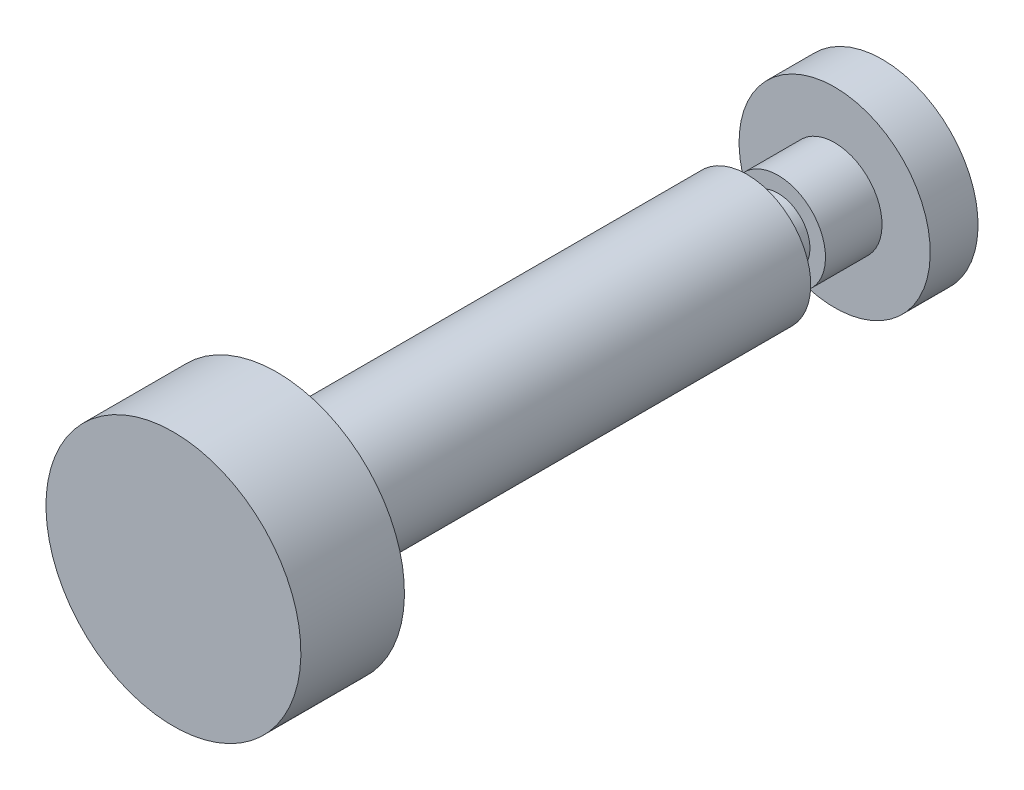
ISO-10303-21;
HEADER;
FILE_DESCRIPTION(('STEP AP214'),'2;1');
FILE_NAME('part.step','',(''),(''),'','','');
FILE_SCHEMA(('AUTOMOTIVE_DESIGN { 1 0 10303 214 1 1 1 1 }'));
ENDSEC;
DATA;
#1=APPLICATION_CONTEXT('core data for automotive mechanical design processes');
#2=APPLICATION_PROTOCOL_DEFINITION('international standard','automotive_design',2000,#1);
#3=PRODUCT_CONTEXT('',#1,'mechanical');
#4=PRODUCT('Part','Part','',(#3));
#5=PRODUCT_RELATED_PRODUCT_CATEGORY('part','',(#4));
#6=PRODUCT_DEFINITION_FORMATION('','',#4);
#7=PRODUCT_DEFINITION_CONTEXT('part definition',#1,'design');
#8=PRODUCT_DEFINITION('design','',#6,#7);
#9=PRODUCT_DEFINITION_SHAPE('','',#8);
#10=(LENGTH_UNIT() NAMED_UNIT(*) SI_UNIT(.MILLI.,.METRE.));
#11=(NAMED_UNIT(*) PLANE_ANGLE_UNIT() SI_UNIT($,.RADIAN.));
#12=(NAMED_UNIT(*) SI_UNIT($,.STERADIAN.) SOLID_ANGLE_UNIT());
#13=UNCERTAINTY_MEASURE_WITH_UNIT(LENGTH_MEASURE(1.E-05),#10,'distance_accuracy_value','');
#14=(GEOMETRIC_REPRESENTATION_CONTEXT(3) GLOBAL_UNCERTAINTY_ASSIGNED_CONTEXT((#13)) GLOBAL_UNIT_ASSIGNED_CONTEXT((#10,
#11,#12)) REPRESENTATION_CONTEXT('',''));
#15=CARTESIAN_POINT('',(0.,0.,0.));
#16=DIRECTION('',(0.,0.,1.));
#17=DIRECTION('',(1.,0.,0.));
#18=AXIS2_PLACEMENT_3D('',#15,#16,#17);
#19=CARTESIAN_POINT('',(0.,0.,0.));
#20=DIRECTION('',(0.,0.,1.));
#21=DIRECTION('',(0.,1.,0.));
#22=AXIS2_PLACEMENT_3D('',#19,#20,#21);
#23=PLANE('',#22);
#24=CARTESIAN_POINT('',(0.,0.,0.));
#25=DIRECTION('',(0.,0.,1.));
#26=DIRECTION('',(0.,1.,0.));
#27=AXIS2_PLACEMENT_3D('',#24,#25,#26);
#28=CIRCLE('',#27,12.);
#29=CARTESIAN_POINT('',(0.,12.,0.));
#30=VERTEX_POINT('',#29);
#31=EDGE_CURVE('E8',#30,#30,#28,.T.);
#32=ORIENTED_EDGE('',*,*,#31,.F.);
#33=EDGE_LOOP('',(#32));
#34=FACE_BOUND('',#33,.T.);
#35=ADVANCED_FACE('F12',(#34),#23,.F.);
#36=CARTESIAN_POINT('',(0.,0.,40.));
#37=DIRECTION('',(0.,0.,1.));
#38=DIRECTION('',(0.,1.,0.));
#39=AXIS2_PLACEMENT_3D('',#36,#37,#38);
#40=CYLINDRICAL_SURFACE('',#39,12.);
#41=CARTESIAN_POINT('',(0.,0.,6.));
#42=DIRECTION('',(0.,0.,1.));
#43=DIRECTION('',(0.,1.,0.));
#44=AXIS2_PLACEMENT_3D('',#41,#42,#43);
#45=CIRCLE('',#44,12.);
#46=CARTESIAN_POINT('',(0.,12.,6.));
#47=VERTEX_POINT('',#46);
#48=EDGE_CURVE('E18',#47,#47,#45,.T.);
#49=ORIENTED_EDGE('',*,*,#48,.F.);
#50=EDGE_LOOP('',(#49));
#51=FACE_BOUND('',#50,.T.);
#52=ORIENTED_EDGE('',*,*,#31,.T.);
#53=EDGE_LOOP('',(#52));
#54=FACE_BOUND('',#53,.T.);
#55=ADVANCED_FACE('F67',(#51,#54),#40,.T.);
#56=CARTESIAN_POINT('',(0.,-12.,6.));
#57=DIRECTION('',(0.,0.,-1.));
#58=DIRECTION('',(0.,-1.,0.));
#59=AXIS2_PLACEMENT_3D('',#56,#57,#58);
#60=PLANE('',#59);
#61=CARTESIAN_POINT('',(0.,0.,6.));
#62=DIRECTION('',(0.,0.,1.));
#63=DIRECTION('',(0.,1.,0.));
#64=AXIS2_PLACEMENT_3D('',#61,#62,#63);
#65=CIRCLE('',#64,5.95);
#66=CARTESIAN_POINT('',(0.,5.95,6.));
#67=VERTEX_POINT('',#66);
#68=EDGE_CURVE('E22',#67,#67,#65,.T.);
#69=ORIENTED_EDGE('',*,*,#68,.F.);
#70=EDGE_LOOP('',(#69));
#71=FACE_BOUND('',#70,.T.);
#72=ORIENTED_EDGE('',*,*,#48,.T.);
#73=EDGE_LOOP('',(#72));
#74=FACE_BOUND('',#73,.T.);
#75=ADVANCED_FACE('F72',(#71,#74),#60,.F.);
#76=CARTESIAN_POINT('',(0.,0.,40.));
#77=DIRECTION('',(0.,0.,1.));
#78=DIRECTION('',(0.,1.,0.));
#79=AXIS2_PLACEMENT_3D('',#76,#77,#78);
#80=CYLINDRICAL_SURFACE('',#79,5.95);
#81=CARTESIAN_POINT('',(0.,0.,13.1));
#82=DIRECTION('',(0.,0.,1.));
#83=DIRECTION('',(0.,1.,0.));
#84=AXIS2_PLACEMENT_3D('',#81,#82,#83);
#85=CIRCLE('',#84,5.95);
#86=CARTESIAN_POINT('',(0.,5.95,13.1));
#87=VERTEX_POINT('',#86);
#88=EDGE_CURVE('E26',#87,#87,#85,.T.);
#89=ORIENTED_EDGE('',*,*,#88,.F.);
#90=EDGE_LOOP('',(#89));
#91=FACE_BOUND('',#90,.T.);
#92=ORIENTED_EDGE('',*,*,#68,.T.);
#93=EDGE_LOOP('',(#92));
#94=FACE_BOUND('',#93,.T.);
#95=ADVANCED_FACE('F77',(#91,#94),#80,.T.);
#96=CARTESIAN_POINT('',(0.,-5.95,13.1));
#97=DIRECTION('',(0.,0.,-1.));
#98=DIRECTION('',(0.,-1.,0.));
#99=AXIS2_PLACEMENT_3D('',#96,#97,#98);
#100=PLANE('',#99);
#101=CARTESIAN_POINT('',(0.,0.,13.1));
#102=DIRECTION('',(0.,0.,1.));
#103=DIRECTION('',(0.,1.,0.));
#104=AXIS2_PLACEMENT_3D('',#101,#102,#103);
#105=CIRCLE('',#104,4.);
#106=CARTESIAN_POINT('',(0.,4.,13.1));
#107=VERTEX_POINT('',#106);
#108=EDGE_CURVE('E31',#107,#107,#105,.T.);
#109=ORIENTED_EDGE('',*,*,#108,.F.);
#110=EDGE_LOOP('',(#109));
#111=FACE_BOUND('',#110,.T.);
#112=ORIENTED_EDGE('',*,*,#88,.T.);
#113=EDGE_LOOP('',(#112));
#114=FACE_BOUND('',#113,.T.);
#115=ADVANCED_FACE('F83',(#111,#114),#100,.F.);
#116=CARTESIAN_POINT('',(0.,0.,40.));
#117=DIRECTION('',(0.,0.,1.));
#118=DIRECTION('',(0.,1.,0.));
#119=AXIS2_PLACEMENT_3D('',#116,#117,#118);
#120=CYLINDRICAL_SURFACE('',#119,4.);
#121=CARTESIAN_POINT('',(0.,0.,17.));
#122=DIRECTION('',(0.,0.,1.));
#123=DIRECTION('',(0.,1.,0.));
#124=AXIS2_PLACEMENT_3D('',#121,#122,#123);
#125=CIRCLE('',#124,4.);
#126=CARTESIAN_POINT('',(0.,4.,17.));
#127=VERTEX_POINT('',#126);
#128=EDGE_CURVE('E34',#127,#127,#125,.T.);
#129=ORIENTED_EDGE('',*,*,#128,.F.);
#130=EDGE_LOOP('',(#129));
#131=FACE_BOUND('',#130,.T.);
#132=ORIENTED_EDGE('',*,*,#108,.T.);
#133=EDGE_LOOP('',(#132));
#134=FACE_BOUND('',#133,.T.);
#135=ADVANCED_FACE('F87',(#131,#134),#120,.T.);
#136=CARTESIAN_POINT('',(0.,-4.,17.));
#137=DIRECTION('',(0.,0.,1.));
#138=DIRECTION('',(0.,1.,0.));
#139=AXIS2_PLACEMENT_3D('',#136,#137,#138);
#140=PLANE('',#139);
#141=CARTESIAN_POINT('',(0.,0.,17.));
#142=DIRECTION('',(0.,0.,1.));
#143=DIRECTION('',(0.,1.,0.));
#144=AXIS2_PLACEMENT_3D('',#141,#142,#143);
#145=CIRCLE('',#144,8.);
#146=CARTESIAN_POINT('',(0.,8.,17.));
#147=VERTEX_POINT('',#146);
#148=EDGE_CURVE('E37',#147,#147,#145,.T.);
#149=ORIENTED_EDGE('',*,*,#148,.F.);
#150=EDGE_LOOP('',(#149));
#151=FACE_BOUND('',#150,.T.);
#152=ORIENTED_EDGE('',*,*,#128,.T.);
#153=EDGE_LOOP('',(#152));
#154=FACE_BOUND('',#153,.T.);
#155=ADVANCED_FACE('F91',(#151,#154),#140,.F.);
#156=CARTESIAN_POINT('',(0.,0.,40.));
#157=DIRECTION('',(0.,0.,1.));
#158=DIRECTION('',(0.,1.,0.));
#159=AXIS2_PLACEMENT_3D('',#156,#157,#158);
#160=CYLINDRICAL_SURFACE('',#159,8.);
#161=CARTESIAN_POINT('',(0.,0.,76.));
#162=DIRECTION('',(0.,0.,1.));
#163=DIRECTION('',(0.,1.,0.));
#164=AXIS2_PLACEMENT_3D('',#161,#162,#163);
#165=CIRCLE('',#164,8.);
#166=CARTESIAN_POINT('',(0.,8.,76.));
#167=VERTEX_POINT('',#166);
#168=EDGE_CURVE('E40',#167,#167,#165,.T.);
#169=ORIENTED_EDGE('',*,*,#168,.F.);
#170=EDGE_LOOP('',(#169));
#171=FACE_BOUND('',#170,.T.);
#172=ORIENTED_EDGE('',*,*,#148,.T.);
#173=EDGE_LOOP('',(#172));
#174=FACE_BOUND('',#173,.T.);
#175=ADVANCED_FACE('F63',(#171,#174),#160,.T.);
#176=CARTESIAN_POINT('',(0.,-16.,76.));
#177=DIRECTION('',(0.,0.,-1.));
#178=DIRECTION('',(0.,-1.,0.));
#179=AXIS2_PLACEMENT_3D('',#176,#177,#178);
#180=PLANE('',#179);
#181=ORIENTED_EDGE('',*,*,#168,.T.);
#182=EDGE_LOOP('',(#181));
#183=FACE_BOUND('',#182,.T.);
#184=CARTESIAN_POINT('',(0.,0.,76.));
#185=DIRECTION('',(0.,0.,1.));
#186=DIRECTION('',(0.,1.,0.));
#187=AXIS2_PLACEMENT_3D('',#184,#185,#186);
#188=CIRCLE('',#187,16.);
#189=CARTESIAN_POINT('',(0.,16.,76.));
#190=VERTEX_POINT('',#189);
#191=EDGE_CURVE('E43',#190,#190,#188,.T.);
#192=ORIENTED_EDGE('',*,*,#191,.F.);
#193=EDGE_LOOP('',(#192));
#194=FACE_BOUND('',#193,.T.);
#195=ADVANCED_FACE('F54',(#183,#194),#180,.T.);
#196=CARTESIAN_POINT('',(0.,0.,40.));
#197=DIRECTION('',(0.,0.,1.));
#198=DIRECTION('',(0.,1.,0.));
#199=AXIS2_PLACEMENT_3D('',#196,#197,#198);
#200=CYLINDRICAL_SURFACE('',#199,16.);
#201=ORIENTED_EDGE('',*,*,#191,.T.);
#202=EDGE_LOOP('',(#201));
#203=FACE_BOUND('',#202,.T.);
#204=CARTESIAN_POINT('',(0.,0.,89.));
#205=DIRECTION('',(0.,0.,1.));
#206=DIRECTION('',(0.,1.,0.));
#207=AXIS2_PLACEMENT_3D('',#204,#205,#206);
#208=CIRCLE('',#207,16.);
#209=CARTESIAN_POINT('',(0.,16.,89.));
#210=VERTEX_POINT('',#209);
#211=EDGE_CURVE('E46',#210,#210,#208,.T.);
#212=ORIENTED_EDGE('',*,*,#211,.F.);
#213=EDGE_LOOP('',(#212));
#214=FACE_BOUND('',#213,.T.);
#215=ADVANCED_FACE('F52',(#203,#214),#200,.T.);
#216=CARTESIAN_POINT('',(0.,-16.,89.));
#217=DIRECTION('',(0.,0.,-1.));
#218=DIRECTION('',(0.,-1.,0.));
#219=AXIS2_PLACEMENT_3D('',#216,#217,#218);
#220=PLANE('',#219);
#221=ORIENTED_EDGE('',*,*,#211,.T.);
#222=EDGE_LOOP('',(#221));
#223=FACE_BOUND('',#222,.T.);
#224=ADVANCED_FACE('F50',(#223),#220,.F.);
#225=CLOSED_SHELL('',(#35,#55,#75,#95,#115,#135,#155,#175,#195,#215,#224));
#226=MANIFOLD_SOLID_BREP('B1',#225);
#227=ADVANCED_BREP_SHAPE_REPRESENTATION('',(#18,#226),#14);
#228=SHAPE_DEFINITION_REPRESENTATION(#9,#227);
ENDSEC;
END-ISO-10303-21;
